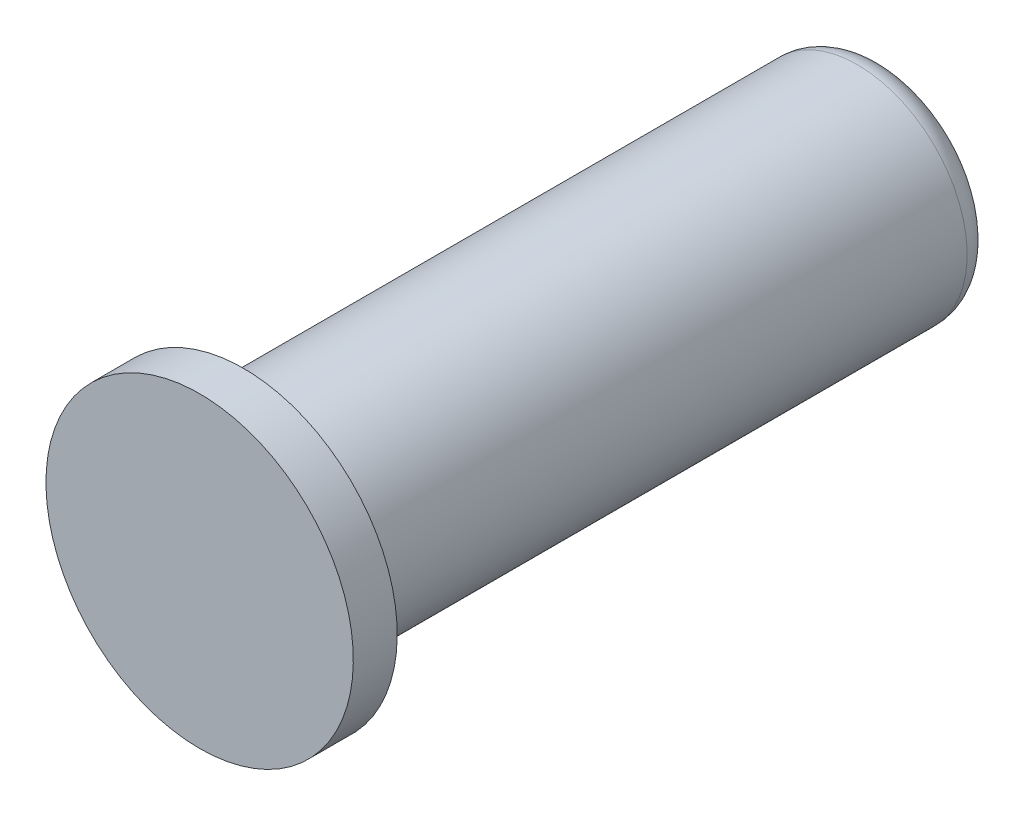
ISO-10303-21;
HEADER;
FILE_DESCRIPTION(('STEP AP214'),'2;1');
FILE_NAME('part.step','',(''),(''),'','','');
FILE_SCHEMA(('AUTOMOTIVE_DESIGN { 1 0 10303 214 1 1 1 1 }'));
ENDSEC;
DATA;
#1=APPLICATION_CONTEXT('core data for automotive mechanical design processes');
#2=APPLICATION_PROTOCOL_DEFINITION('international standard','automotive_design',2000,#1);
#3=PRODUCT_CONTEXT('',#1,'mechanical');
#4=PRODUCT('Part','Part','',(#3));
#5=PRODUCT_RELATED_PRODUCT_CATEGORY('part','',(#4));
#6=PRODUCT_DEFINITION_FORMATION('','',#4);
#7=PRODUCT_DEFINITION_CONTEXT('part definition',#1,'design');
#8=PRODUCT_DEFINITION('design','',#6,#7);
#9=PRODUCT_DEFINITION_SHAPE('','',#8);
#10=(LENGTH_UNIT() NAMED_UNIT(*) SI_UNIT(.MILLI.,.METRE.));
#11=(NAMED_UNIT(*) PLANE_ANGLE_UNIT() SI_UNIT($,.RADIAN.));
#12=(NAMED_UNIT(*) SI_UNIT($,.STERADIAN.) SOLID_ANGLE_UNIT());
#13=UNCERTAINTY_MEASURE_WITH_UNIT(LENGTH_MEASURE(1.E-05),#10,'distance_accuracy_value','');
#14=(GEOMETRIC_REPRESENTATION_CONTEXT(3) GLOBAL_UNCERTAINTY_ASSIGNED_CONTEXT((#13)) GLOBAL_UNIT_ASSIGNED_CONTEXT((#10,
#11,#12)) REPRESENTATION_CONTEXT('',''));
#15=CARTESIAN_POINT('',(0.,0.,0.));
#16=DIRECTION('',(0.,0.,1.));
#17=DIRECTION('',(1.,0.,0.));
#18=AXIS2_PLACEMENT_3D('',#15,#16,#17);
#19=CARTESIAN_POINT('',(0.,0.,0.));
#20=DIRECTION('',(0.,0.,-1.));
#21=DIRECTION('',(0.,1.,0.));
#22=AXIS2_PLACEMENT_3D('',#19,#20,#21);
#23=PLANE('',#22);
#24=CARTESIAN_POINT('',(0.,0.,0.));
#25=DIRECTION('',(0.,0.,1.));
#26=DIRECTION('',(0.,-1.,0.));
#27=AXIS2_PLACEMENT_3D('',#24,#25,#26);
#28=CIRCLE('',#27,17.5);
#29=CARTESIAN_POINT('',(0.,-17.5,0.));
#30=VERTEX_POINT('',#29);
#31=EDGE_CURVE('E11',#30,#30,#28,.T.);
#32=ORIENTED_EDGE('',*,*,#31,.T.);
#33=EDGE_LOOP('',(#32));
#34=FACE_BOUND('',#33,.T.);
#35=ADVANCED_FACE('F30',(#34),#23,.F.);
#36=CARTESIAN_POINT('',(0.,0.,0.));
#37=DIRECTION('',(0.,0.,1.));
#38=DIRECTION('',(0.,-1.,0.));
#39=AXIS2_PLACEMENT_3D('',#36,#37,#38);
#40=CYLINDRICAL_SURFACE('',#39,17.5);
#41=CARTESIAN_POINT('',(0.,0.,-5.));
#42=DIRECTION('',(0.,0.,1.));
#43=DIRECTION('',(0.,-1.,0.));
#44=AXIS2_PLACEMENT_3D('',#41,#42,#43);
#45=CIRCLE('',#44,17.5);
#46=CARTESIAN_POINT('',(0.,-17.5,-5.));
#47=VERTEX_POINT('',#46);
#48=EDGE_CURVE('E36',#47,#47,#45,.T.);
#49=CARTESIAN_POINT('',(0.,-17.5,0.));
#50=CARTESIAN_POINT('',(0.,-17.5,-0.0520833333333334));
#51=CARTESIAN_POINT('',(0.,-17.5,-0.104166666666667));
#52=CARTESIAN_POINT('',(0.,-17.5,-0.208333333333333));
#53=CARTESIAN_POINT('',(0.,-17.5,-0.260416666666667));
#54=CARTESIAN_POINT('',(0.,-17.5,-0.364583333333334));
#55=CARTESIAN_POINT('',(0.,-17.5,-0.416666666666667));
#56=CARTESIAN_POINT('',(0.,-17.5,-0.520833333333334));
#57=CARTESIAN_POINT('',(0.,-17.5,-0.572916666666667));
#58=CARTESIAN_POINT('',(0.,-17.5,-0.677083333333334));
#59=CARTESIAN_POINT('',(0.,-17.5,-0.729166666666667));
#60=CARTESIAN_POINT('',(0.,-17.5,-0.833333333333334));
#61=CARTESIAN_POINT('',(0.,-17.5,-0.885416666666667));
#62=CARTESIAN_POINT('',(0.,-17.5,-0.989583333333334));
#63=CARTESIAN_POINT('',(0.,-17.5,-1.04166666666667));
#64=CARTESIAN_POINT('',(0.,-17.5,-1.14583333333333));
#65=CARTESIAN_POINT('',(0.,-17.5,-1.19791666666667));
#66=CARTESIAN_POINT('',(0.,-17.5,-1.30208333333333));
#67=CARTESIAN_POINT('',(0.,-17.5,-1.35416666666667));
#68=CARTESIAN_POINT('',(0.,-17.5,-1.45833333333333));
#69=CARTESIAN_POINT('',(0.,-17.5,-1.51041666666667));
#70=CARTESIAN_POINT('',(0.,-17.5,-1.61458333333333));
#71=CARTESIAN_POINT('',(0.,-17.5,-1.66666666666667));
#72=CARTESIAN_POINT('',(0.,-17.5,-1.77083333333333));
#73=CARTESIAN_POINT('',(0.,-17.5,-1.82291666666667));
#74=CARTESIAN_POINT('',(0.,-17.5,-1.92708333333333));
#75=CARTESIAN_POINT('',(0.,-17.5,-1.97916666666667));
#76=CARTESIAN_POINT('',(0.,-17.5,-2.08333333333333));
#77=CARTESIAN_POINT('',(0.,-17.5,-2.13541666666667));
#78=CARTESIAN_POINT('',(0.,-17.5,-2.23958333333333));
#79=CARTESIAN_POINT('',(0.,-17.5,-2.29166666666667));
#80=CARTESIAN_POINT('',(0.,-17.5,-2.39583333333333));
#81=CARTESIAN_POINT('',(0.,-17.5,-2.44791666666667));
#82=CARTESIAN_POINT('',(0.,-17.5,-2.55208333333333));
#83=CARTESIAN_POINT('',(0.,-17.5,-2.60416666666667));
#84=CARTESIAN_POINT('',(0.,-17.5,-2.70833333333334));
#85=CARTESIAN_POINT('',(0.,-17.5,-2.76041666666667));
#86=CARTESIAN_POINT('',(0.,-17.5,-2.86458333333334));
#87=CARTESIAN_POINT('',(0.,-17.5,-2.91666666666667));
#88=CARTESIAN_POINT('',(0.,-17.5,-3.02083333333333));
#89=CARTESIAN_POINT('',(0.,-17.5,-3.07291666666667));
#90=CARTESIAN_POINT('',(0.,-17.5,-3.17708333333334));
#91=CARTESIAN_POINT('',(0.,-17.5,-3.22916666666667));
#92=CARTESIAN_POINT('',(0.,-17.5,-3.33333333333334));
#93=CARTESIAN_POINT('',(0.,-17.5,-3.38541666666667));
#94=CARTESIAN_POINT('',(0.,-17.5,-3.48958333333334));
#95=CARTESIAN_POINT('',(0.,-17.5,-3.54166666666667));
#96=CARTESIAN_POINT('',(0.,-17.5,-3.64583333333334));
#97=CARTESIAN_POINT('',(0.,-17.5,-3.69791666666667));
#98=CARTESIAN_POINT('',(0.,-17.5,-3.80208333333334));
#99=CARTESIAN_POINT('',(0.,-17.5,-3.85416666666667));
#100=CARTESIAN_POINT('',(0.,-17.5,-3.95833333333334));
#101=CARTESIAN_POINT('',(0.,-17.5,-4.01041666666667));
#102=CARTESIAN_POINT('',(0.,-17.5,-4.11458333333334));
#103=CARTESIAN_POINT('',(0.,-17.5,-4.16666666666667));
#104=CARTESIAN_POINT('',(0.,-17.5,-4.27083333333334));
#105=CARTESIAN_POINT('',(0.,-17.5,-4.32291666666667));
#106=CARTESIAN_POINT('',(0.,-17.5,-4.42708333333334));
#107=CARTESIAN_POINT('',(0.,-17.5,-4.47916666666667));
#108=CARTESIAN_POINT('',(0.,-17.5,-4.58333333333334));
#109=CARTESIAN_POINT('',(0.,-17.5,-4.63541666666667));
#110=CARTESIAN_POINT('',(0.,-17.5,-4.73958333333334));
#111=CARTESIAN_POINT('',(0.,-17.5,-4.79166666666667));
#112=CARTESIAN_POINT('',(0.,-17.5,-4.89583333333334));
#113=CARTESIAN_POINT('',(0.,-17.5,-4.94791666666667));
#114=CARTESIAN_POINT('',(0.,-17.5,-5.));
#115=B_SPLINE_CURVE_WITH_KNOTS('',3,(#49,#50,#51,#52,#53,#54,#55,#56,#57,#58,#59,#60,#61,#62,
#63,#64,#65,#66,#67,#68,#69,#70,#71,#72,#73,#74,#75,#76,#77,#78,#79,#80,#81,#82,#83,#84,#85,#86,
#87,#88,#89,#90,#91,#92,#93,#94,#95,#96,#97,#98,#99,#100,#101,#102,#103,#104,#105,#106,#107,
#108,#109,#110,#111,#112,#113,#114),.UNSPECIFIED.,.F.,.F.,(4,2,2,2,2,2,2,2,2,2,2,2,2,2,2,2,2,2,
2,2,2,2,2,2,2,2,2,2,2,2,2,2,4),(0.,0.15625,0.3125,0.46875,0.625,0.78125,0.937500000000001,
1.09375,1.25,1.40625,1.5625,1.71875,1.875,2.03125,2.1875,2.34375,2.5,2.65625,2.8125,2.96875,
3.125,3.28125,3.4375,3.59375,3.75,3.90625,4.0625,4.21875,4.375,4.53125,4.6875,4.84375,5.),.UNSPECIFIED.);
#116=EDGE_CURVE('BSEAM52',#30,#47,#115,.T.);
#117=ORIENTED_EDGE('',*,*,#31,.F.);
#118=ORIENTED_EDGE('',*,*,#48,.T.);
#119=ORIENTED_EDGE('',*,*,#116,.T.);
#120=ORIENTED_EDGE('',*,*,#116,.F.);
#121=EDGE_LOOP('',(#117,#119,#118,#120));
#122=FACE_BOUND('',#121,.T.);
#123=ADVANCED_FACE('F52',(#122),#40,.T.);
#124=CARTESIAN_POINT('',(0.,17.5,-5.));
#125=DIRECTION('',(0.,0.,1.));
#126=DIRECTION('',(0.,-1.,0.));
#127=AXIS2_PLACEMENT_3D('',#124,#125,#126);
#128=PLANE('',#127);
#129=ORIENTED_EDGE('',*,*,#48,.F.);
#130=EDGE_LOOP('',(#129));
#131=FACE_BOUND('',#130,.T.);
#132=CARTESIAN_POINT('',(0.,0.,-5.));
#133=DIRECTION('',(0.,0.,1.));
#134=DIRECTION('',(0.,-1.,0.));
#135=AXIS2_PLACEMENT_3D('',#132,#133,#134);
#136=CIRCLE('',#135,12.5);
#137=CARTESIAN_POINT('',(0.,-12.5,-5.));
#138=VERTEX_POINT('',#137);
#139=EDGE_CURVE('E64',#138,#138,#136,.T.);
#140=ORIENTED_EDGE('',*,*,#139,.T.);
#141=EDGE_LOOP('',(#140));
#142=FACE_BOUND('',#141,.T.);
#143=ADVANCED_FACE('F57',(#131,#142),#128,.F.);
#144=CARTESIAN_POINT('',(0.,0.,0.));
#145=DIRECTION('',(0.,0.,1.));
#146=DIRECTION('',(0.,-1.,0.));
#147=AXIS2_PLACEMENT_3D('',#144,#145,#146);
#148=CYLINDRICAL_SURFACE('',#147,12.5);
#149=CARTESIAN_POINT('',(0.,0.,-74.9));
#150=DIRECTION('',(0.,0.,1.));
#151=DIRECTION('',(0.,-1.,0.));
#152=AXIS2_PLACEMENT_3D('',#149,#150,#151);
#153=CIRCLE('',#152,12.5);
#154=CARTESIAN_POINT('',(0.,-12.5,-74.9));
#155=VERTEX_POINT('',#154);
#156=EDGE_CURVE('E66',#155,#155,#153,.T.);
#157=CARTESIAN_POINT('',(0.,-12.5,-5.));
#158=CARTESIAN_POINT('',(0.,-12.5,-5.728125));
#159=CARTESIAN_POINT('',(0.,-12.5,-6.45625));
#160=CARTESIAN_POINT('',(0.,-12.5,-7.9125));
#161=CARTESIAN_POINT('',(0.,-12.5,-8.640625));
#162=CARTESIAN_POINT('',(0.,-12.5,-10.096875));
#163=CARTESIAN_POINT('',(0.,-12.5,-10.825));
#164=CARTESIAN_POINT('',(0.,-12.5,-12.28125));
#165=CARTESIAN_POINT('',(0.,-12.5,-13.009375));
#166=CARTESIAN_POINT('',(0.,-12.5,-14.465625));
#167=CARTESIAN_POINT('',(0.,-12.5,-15.19375));
#168=CARTESIAN_POINT('',(0.,-12.5,-16.65));
#169=CARTESIAN_POINT('',(0.,-12.5,-17.378125));
#170=CARTESIAN_POINT('',(0.,-12.5,-18.834375));
#171=CARTESIAN_POINT('',(0.,-12.5,-19.5625));
#172=CARTESIAN_POINT('',(0.,-12.5,-21.01875));
#173=CARTESIAN_POINT('',(0.,-12.5,-21.746875));
#174=CARTESIAN_POINT('',(0.,-12.5,-23.203125));
#175=CARTESIAN_POINT('',(0.,-12.5,-23.93125));
#176=CARTESIAN_POINT('',(0.,-12.5,-25.3875));
#177=CARTESIAN_POINT('',(0.,-12.5,-26.115625));
#178=CARTESIAN_POINT('',(0.,-12.5,-27.571875));
#179=CARTESIAN_POINT('',(0.,-12.5,-28.3));
#180=CARTESIAN_POINT('',(0.,-12.5,-29.75625));
#181=CARTESIAN_POINT('',(0.,-12.5,-30.484375));
#182=CARTESIAN_POINT('',(0.,-12.5,-31.940625));
#183=CARTESIAN_POINT('',(0.,-12.5,-32.66875));
#184=CARTESIAN_POINT('',(0.,-12.5,-34.125));
#185=CARTESIAN_POINT('',(0.,-12.5,-34.853125));
#186=CARTESIAN_POINT('',(0.,-12.5,-36.309375));
#187=CARTESIAN_POINT('',(0.,-12.5,-37.0375));
#188=CARTESIAN_POINT('',(0.,-12.5,-38.49375));
#189=CARTESIAN_POINT('',(0.,-12.5,-39.221875));
#190=CARTESIAN_POINT('',(0.,-12.5,-40.678125));
#191=CARTESIAN_POINT('',(0.,-12.5,-41.40625));
#192=CARTESIAN_POINT('',(0.,-12.5,-42.8625));
#193=CARTESIAN_POINT('',(0.,-12.5,-43.590625));
#194=CARTESIAN_POINT('',(0.,-12.5,-45.046875));
#195=CARTESIAN_POINT('',(0.,-12.5,-45.775));
#196=CARTESIAN_POINT('',(0.,-12.5,-47.23125));
#197=CARTESIAN_POINT('',(0.,-12.5,-47.959375));
#198=CARTESIAN_POINT('',(0.,-12.5,-49.415625));
#199=CARTESIAN_POINT('',(0.,-12.5,-50.14375));
#200=CARTESIAN_POINT('',(0.,-12.5,-51.6));
#201=CARTESIAN_POINT('',(0.,-12.5,-52.328125));
#202=CARTESIAN_POINT('',(0.,-12.5,-53.784375));
#203=CARTESIAN_POINT('',(0.,-12.5,-54.5125));
#204=CARTESIAN_POINT('',(0.,-12.5,-55.96875));
#205=CARTESIAN_POINT('',(0.,-12.5,-56.696875));
#206=CARTESIAN_POINT('',(0.,-12.5,-58.153125));
#207=CARTESIAN_POINT('',(0.,-12.5,-58.88125));
#208=CARTESIAN_POINT('',(0.,-12.5,-60.3375));
#209=CARTESIAN_POINT('',(0.,-12.5,-61.065625));
#210=CARTESIAN_POINT('',(0.,-12.5,-62.521875));
#211=CARTESIAN_POINT('',(0.,-12.5,-63.25));
#212=CARTESIAN_POINT('',(0.,-12.5,-64.70625));
#213=CARTESIAN_POINT('',(0.,-12.5,-65.434375));
#214=CARTESIAN_POINT('',(0.,-12.5,-66.890625));
#215=CARTESIAN_POINT('',(0.,-12.5,-67.61875));
#216=CARTESIAN_POINT('',(0.,-12.5,-69.075));
#217=CARTESIAN_POINT('',(0.,-12.5,-69.803125));
#218=CARTESIAN_POINT('',(0.,-12.5,-71.259375));
#219=CARTESIAN_POINT('',(0.,-12.5,-71.9875));
#220=CARTESIAN_POINT('',(0.,-12.5,-73.44375));
#221=CARTESIAN_POINT('',(0.,-12.5,-74.171875));
#222=CARTESIAN_POINT('',(0.,-12.5,-74.9));
#223=B_SPLINE_CURVE_WITH_KNOTS('',3,(#157,#158,#159,#160,#161,#162,#163,#164,#165,#166,#167,
#168,#169,#170,#171,#172,#173,#174,#175,#176,#177,#178,#179,#180,#181,#182,#183,#184,#185,#186,
#187,#188,#189,#190,#191,#192,#193,#194,#195,#196,#197,#198,#199,#200,#201,#202,#203,#204,#205,
#206,#207,#208,#209,#210,#211,#212,#213,#214,#215,#216,#217,#218,#219,#220,#221,#222),
.UNSPECIFIED.,.F.,.F.,(4,2,2,2,2,2,2,2,2,2,2,2,2,2,2,2,2,2,2,2,2,2,2,2,2,2,2,2,2,2,2,2,4),(0.,
2.184375,4.36875,6.553125,8.7375,10.921875,13.10625,15.290625,17.475,19.659375,21.84375,
24.028125,26.2125,28.396875,30.58125,32.765625,34.95,37.134375,39.31875,41.503125,43.6875,
45.871875,48.05625,50.240625,52.425,54.609375,56.79375,58.978125,61.1625,63.346875,65.53125,
67.715625,69.9),.UNSPECIFIED.);
#224=EDGE_CURVE('BSEAM99',#138,#155,#223,.T.);
#225=ORIENTED_EDGE('',*,*,#139,.F.);
#226=ORIENTED_EDGE('',*,*,#156,.T.);
#227=ORIENTED_EDGE('',*,*,#224,.T.);
#228=ORIENTED_EDGE('',*,*,#224,.F.);
#229=EDGE_LOOP('',(#225,#227,#226,#228));
#230=FACE_BOUND('',#229,.T.);
#231=ADVANCED_FACE('F99',(#230),#148,.T.);
#232=CARTESIAN_POINT('',(0.,0.,-74.9));
#233=DIRECTION('',(0.,0.,1.));
#234=DIRECTION('',(0.,-1.,0.));
#235=AXIS2_PLACEMENT_3D('',#232,#233,#234);
#236=TOROIDAL_SURFACE('',#235,9.5,3.);
#237=ORIENTED_EDGE('',*,*,#156,.F.);
#238=EDGE_LOOP('',(#237));
#239=FACE_BOUND('',#238,.T.);
#240=CARTESIAN_POINT('',(0.,0.,-77.9));
#241=DIRECTION('',(0.,0.,1.));
#242=DIRECTION('',(0.,-1.,0.));
#243=AXIS2_PLACEMENT_3D('',#240,#241,#242);
#244=CIRCLE('',#243,9.5);
#245=CARTESIAN_POINT('',(0.,-9.5,-77.9));
#246=VERTEX_POINT('',#245);
#247=EDGE_CURVE('E71',#246,#246,#244,.T.);
#248=ORIENTED_EDGE('',*,*,#247,.T.);
#249=EDGE_LOOP('',(#248));
#250=FACE_BOUND('',#249,.T.);
#251=ADVANCED_FACE('F92',(#239,#250),#236,.T.);
#252=CARTESIAN_POINT('',(0.,9.5,-77.9));
#253=DIRECTION('',(0.,0.,1.));
#254=DIRECTION('',(0.,-1.,0.));
#255=AXIS2_PLACEMENT_3D('',#252,#253,#254);
#256=PLANE('',#255);
#257=ORIENTED_EDGE('',*,*,#247,.F.);
#258=EDGE_LOOP('',(#257));
#259=FACE_BOUND('',#258,.T.);
#260=CARTESIAN_POINT('',(0.,0.,-77.9));
#261=DIRECTION('',(0.,0.,1.));
#262=DIRECTION('',(0.,-1.,0.));
#263=AXIS2_PLACEMENT_3D('',#260,#261,#262);
#264=CIRCLE('',#263,4.50000000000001);
#265=CARTESIAN_POINT('',(0.,4.50000000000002,-77.9));
#266=VERTEX_POINT('',#265);
#267=EDGE_CURVE('E74',#266,#266,#264,.T.);
#268=ORIENTED_EDGE('',*,*,#267,.T.);
#269=EDGE_LOOP('',(#268));
#270=FACE_BOUND('',#269,.T.);
#271=ADVANCED_FACE('F86',(#259,#270),#256,.F.);
#272=CARTESIAN_POINT('',(0.,0.,-77.4));
#273=DIRECTION('',(0.,0.,-1.));
#274=DIRECTION('',(0.,1.,0.));
#275=AXIS2_PLACEMENT_3D('',#272,#273,#274);
#276=CONICAL_SURFACE('',#275,4.,0.785398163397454);
#277=CARTESIAN_POINT('',(0.,0.,-77.4));
#278=DIRECTION('',(0.,0.,1.));
#279=DIRECTION('',(0.,-1.,0.));
#280=AXIS2_PLACEMENT_3D('',#277,#278,#279);
#281=CIRCLE('',#280,4.);
#282=CARTESIAN_POINT('',(0.,4.00000000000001,-77.4));
#283=VERTEX_POINT('',#282);
#284=EDGE_CURVE('E77',#283,#283,#281,.T.);
#285=CARTESIAN_POINT('',(0.,4.50000000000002,-77.9));
#286=CARTESIAN_POINT('',(0.,4.49479166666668,-77.8947916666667));
#287=CARTESIAN_POINT('',(0.,4.48958333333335,-77.8895833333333));
#288=CARTESIAN_POINT('',(0.,4.47916666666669,-77.8791666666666));
#289=CARTESIAN_POINT('',(0.,4.47395833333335,-77.8739583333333));
#290=CARTESIAN_POINT('',(0.,4.46354166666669,-77.8635416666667));
#291=CARTESIAN_POINT('',(0.,4.45833333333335,-77.8583333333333));
#292=CARTESIAN_POINT('',(0.,4.44791666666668,-77.8479166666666));
#293=CARTESIAN_POINT('',(0.,4.44270833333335,-77.8427083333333));
#294=CARTESIAN_POINT('',(0.,4.43229166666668,-77.8322916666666));
#295=CARTESIAN_POINT('',(0.,4.42708333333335,-77.8270833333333));
#296=CARTESIAN_POINT('',(0.,4.41666666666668,-77.8166666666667));
#297=CARTESIAN_POINT('',(0.,4.41145833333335,-77.8114583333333));
#298=CARTESIAN_POINT('',(0.,4.40104166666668,-77.8010416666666));
#299=CARTESIAN_POINT('',(0.,4.39583333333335,-77.7958333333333));
#300=CARTESIAN_POINT('',(0.,4.38541666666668,-77.7854166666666));
#301=CARTESIAN_POINT('',(0.,4.38020833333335,-77.7802083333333));
#302=CARTESIAN_POINT('',(0.,4.36979166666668,-77.7697916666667));
#303=CARTESIAN_POINT('',(0.,4.36458333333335,-77.7645833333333));
#304=CARTESIAN_POINT('',(0.,4.35416666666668,-77.7541666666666));
#305=CARTESIAN_POINT('',(0.,4.34895833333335,-77.7489583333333));
#306=CARTESIAN_POINT('',(0.,4.33854166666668,-77.7385416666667));
#307=CARTESIAN_POINT('',(0.,4.33333333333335,-77.7333333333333));
#308=CARTESIAN_POINT('',(0.,4.32291666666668,-77.7229166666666));
#309=CARTESIAN_POINT('',(0.,4.31770833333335,-77.7177083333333));
#310=CARTESIAN_POINT('',(0.,4.30729166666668,-77.7072916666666));
#311=CARTESIAN_POINT('',(0.,4.30208333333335,-77.7020833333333));
#312=CARTESIAN_POINT('',(0.,4.29166666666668,-77.6916666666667));
#313=CARTESIAN_POINT('',(0.,4.28645833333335,-77.6864583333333));
#314=CARTESIAN_POINT('',(0.,4.27604166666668,-77.6760416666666));
#315=CARTESIAN_POINT('',(0.,4.27083333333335,-77.6708333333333));
#316=CARTESIAN_POINT('',(0.,4.26041666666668,-77.6604166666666));
#317=CARTESIAN_POINT('',(0.,4.25520833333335,-77.6552083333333));
#318=CARTESIAN_POINT('',(0.,4.24479166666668,-77.6447916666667));
#319=CARTESIAN_POINT('',(0.,4.23958333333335,-77.6395833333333));
#320=CARTESIAN_POINT('',(0.,4.22916666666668,-77.6291666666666));
#321=CARTESIAN_POINT('',(0.,4.22395833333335,-77.6239583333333));
#322=CARTESIAN_POINT('',(0.,4.21354166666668,-77.6135416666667));
#323=CARTESIAN_POINT('',(0.,4.20833333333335,-77.6083333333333));
#324=CARTESIAN_POINT('',(0.,4.19791666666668,-77.5979166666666));
#325=CARTESIAN_POINT('',(0.,4.19270833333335,-77.5927083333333));
#326=CARTESIAN_POINT('',(0.,4.18229166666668,-77.5822916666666));
#327=CARTESIAN_POINT('',(0.,4.17708333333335,-77.5770833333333));
#328=CARTESIAN_POINT('',(0.,4.16666666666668,-77.5666666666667));
#329=CARTESIAN_POINT('',(0.,4.16145833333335,-77.5614583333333));
#330=CARTESIAN_POINT('',(0.,4.15104166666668,-77.5510416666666));
#331=CARTESIAN_POINT('',(0.,4.14583333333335,-77.5458333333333));
#332=CARTESIAN_POINT('',(0.,4.13541666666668,-77.5354166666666));
#333=CARTESIAN_POINT('',(0.,4.13020833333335,-77.5302083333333));
#334=CARTESIAN_POINT('',(0.,4.11979166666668,-77.5197916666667));
#335=CARTESIAN_POINT('',(0.,4.11458333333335,-77.5145833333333));
#336=CARTESIAN_POINT('',(0.,4.10416666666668,-77.5041666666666));
#337=CARTESIAN_POINT('',(0.,4.09895833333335,-77.4989583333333));
#338=CARTESIAN_POINT('',(0.,4.08854166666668,-77.4885416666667));
#339=CARTESIAN_POINT('',(0.,4.08333333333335,-77.4833333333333));
#340=CARTESIAN_POINT('',(0.,4.07291666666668,-77.4729166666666));
#341=CARTESIAN_POINT('',(0.,4.06770833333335,-77.4677083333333));
#342=CARTESIAN_POINT('',(0.,4.05729166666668,-77.4572916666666));
#343=CARTESIAN_POINT('',(0.,4.05208333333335,-77.4520833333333));
#344=CARTESIAN_POINT('',(0.,4.04166666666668,-77.4416666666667));
#345=CARTESIAN_POINT('',(0.,4.03645833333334,-77.4364583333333));
#346=CARTESIAN_POINT('',(0.,4.02604166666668,-77.4260416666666));
#347=CARTESIAN_POINT('',(0.,4.02083333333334,-77.4208333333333));
#348=CARTESIAN_POINT('',(0.,4.01041666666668,-77.4104166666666));
#349=CARTESIAN_POINT('',(0.,4.00520833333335,-77.4052083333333));
#350=CARTESIAN_POINT('',(0.,4.00000000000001,-77.4));
#351=B_SPLINE_CURVE_WITH_KNOTS('',3,(#285,#286,#287,#288,#289,#290,#291,#292,#293,#294,#295,
#296,#297,#298,#299,#300,#301,#302,#303,#304,#305,#306,#307,#308,#309,#310,#311,#312,#313,#314,
#315,#316,#317,#318,#319,#320,#321,#322,#323,#324,#325,#326,#327,#328,#329,#330,#331,#332,#333,
#334,#335,#336,#337,#338,#339,#340,#341,#342,#343,#344,#345,#346,#347,#348,#349,#350),
.UNSPECIFIED.,.F.,.F.,(4,2,2,2,2,2,2,2,2,2,2,2,2,2,2,2,2,2,2,2,2,2,2,2,2,2,2,2,2,2,2,2,4),(0.,
0.0220970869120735,0.0441941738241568,0.0662912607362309,0.0883883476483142,0.110485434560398,
0.132582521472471,0.154679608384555,0.176776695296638,0.198873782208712,0.220970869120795,
0.243067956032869,0.265165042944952,0.287262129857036,0.309359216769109,0.331456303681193,
0.353553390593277,0.37565047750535,0.397747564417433,0.419844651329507,0.44194173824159,
0.464038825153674,0.486135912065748,0.508232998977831,0.530330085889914,0.552427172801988,
0.574524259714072,0.596621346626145,0.618718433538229,0.640815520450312,0.662912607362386,
0.685009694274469,0.707106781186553),.UNSPECIFIED.);
#352=EDGE_CURVE('BSEAM47',#266,#283,#351,.T.);
#353=ORIENTED_EDGE('',*,*,#267,.F.);
#354=ORIENTED_EDGE('',*,*,#284,.T.);
#355=ORIENTED_EDGE('',*,*,#352,.T.);
#356=ORIENTED_EDGE('',*,*,#352,.F.);
#357=EDGE_LOOP('',(#353,#355,#354,#356));
#358=FACE_BOUND('',#357,.T.);
#359=ADVANCED_FACE('F47',(#358),#276,.F.);
#360=CARTESIAN_POINT('',(0.,0.,0.));
#361=DIRECTION('',(0.,0.,1.));
#362=DIRECTION('',(0.,-1.,0.));
#363=AXIS2_PLACEMENT_3D('',#360,#361,#362);
#364=CYLINDRICAL_SURFACE('',#363,4.);
#365=ORIENTED_EDGE('',*,*,#284,.F.);
#366=EDGE_LOOP('',(#365));
#367=FACE_BOUND('',#366,.T.);
#368=CARTESIAN_POINT('',(0.,0.,-68.9));
#369=DIRECTION('',(0.,0.,1.));
#370=DIRECTION('',(0.,-1.,0.));
#371=AXIS2_PLACEMENT_3D('',#368,#369,#370);
#372=CIRCLE('',#371,4.);
#373=CARTESIAN_POINT('',(0.,-4.,-68.9));
#374=VERTEX_POINT('',#373);
#375=EDGE_CURVE('E80',#374,#374,#372,.T.);
#376=ORIENTED_EDGE('',*,*,#375,.T.);
#377=EDGE_LOOP('',(#376));
#378=FACE_BOUND('',#377,.T.);
#379=ADVANCED_FACE('F41',(#367,#378),#364,.F.);
#380=CARTESIAN_POINT('',(0.,0.,-66.5905989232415));
#381=DIRECTION('',(0.,0.,-1.));
#382=DIRECTION('',(0.,1.,0.));
#383=AXIS2_PLACEMENT_3D('',#380,#381,#382);
#384=CONICAL_SURFACE('',#383,0.,1.0471975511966);
#385=ORIENTED_EDGE('',*,*,#375,.F.);
#386=EDGE_LOOP('',(#385));
#387=FACE_BOUND('',#386,.T.);
#388=CARTESIAN_POINT('',(0.,0.,-66.5905989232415));
#389=VERTEX_POINT('',#388);
#390=VERTEX_LOOP('',#389);
#391=FACE_BOUND('',#390,.T.);
#392=ADVANCED_FACE('F39',(#387,#391),#384,.F.);
#393=CLOSED_SHELL('',(#35,#123,#143,#231,#251,#271,#359,#379,#392));
#394=MANIFOLD_SOLID_BREP('B2',#393);
#395=ADVANCED_BREP_SHAPE_REPRESENTATION('',(#18,#394),#14);
#396=SHAPE_DEFINITION_REPRESENTATION(#9,#395);
ENDSEC;
END-ISO-10303-21;
